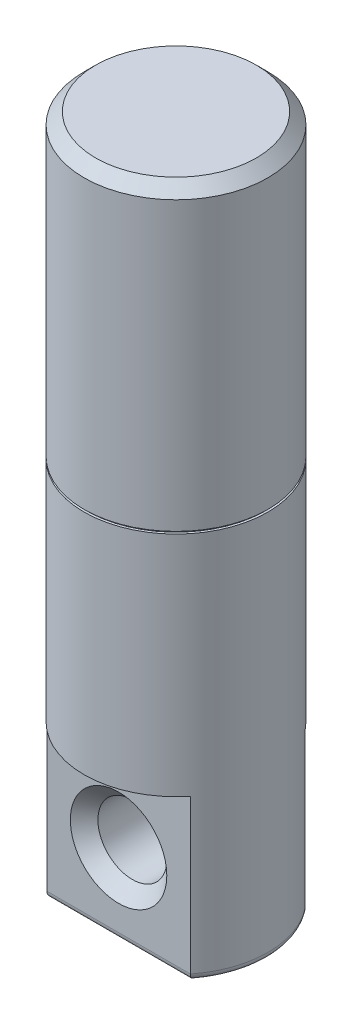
from build123d import *

# Parameters (mm, degrees)
SKETCH1_R               = 2
EXTRUDE1_DEPTH          = 15
CHAMFER1_SIZE           = 0.25
CUT_EXTRUDE1_DEPTH      = 3.5
SKETCH3_W               = 0.370716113
SKETCH3_H               = 0.05
CUT_EXTRUDE2_DEPTH      = 16.264337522
CUT_EXTRUDE2_DEPTH_BACK = 16.264337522
SKETCH4_R               = 0.75
CHAMFER2_SIZE           = 0.3
FILLET1_R               = 0.15


with BuildPart() as part:
    # Sketch1 → Extrude1 (new body)
    with BuildSketch(Plane(origin=(0, 0, 0), x_dir=(1, 0, 0), z_dir=(0, 1, 0))):
        with Locations(Location((0, 0, 0), (0, 0, 270))):
            Circle(SKETCH1_R)
    extrude(amount=EXTRUDE1_DEPTH)

    # Chamfer1
    chamfer1_edges = [part.edges().sort_by_distance(p)[0] for p in [
        (0, 15, -2),
    ]]
    chamfer(chamfer1_edges, length=CHAMFER1_SIZE)

    # Sketch2 → Cut-Extrude1 (cut)
    with BuildSketch(Plane.XZ):
        with BuildLine():
            Line((1.5612495, -1.25), (-1.5612495, -1.25))
            ThreePointArc((-1.5612495, -1.25), (0, -2), (1.5612495, -1.25))
        make_face()
    cut_extrude1 = extrude(amount=-CUT_EXTRUDE1_DEPTH, mode=Mode.SUBTRACT)

    # Mirror1: Cut-Extrude1 across plane
    add(cut_extrude1.mirror(Plane.XY), mode=Mode.SUBTRACT)

    # Sketch3 → Cut-Revolve1 (revolve, cut)
    with BuildSketch(Plane.XY, mode=Mode.PRIVATE) as cut_revolve1_sk:
        with Locations((2.135358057, 8.475)):
            Rectangle(SKETCH3_W, SKETCH3_H)
    revolve(cut_revolve1_sk.sketch.rotate(Axis((0, 0, 0), (0, 1, 0)), 90), axis=Axis((0, 0, 0), (0, 1, 0)), mode=Mode.SUBTRACT)

    # Sketch4 → Cut-Extrude2 (cut, two sides: drawn at the far end of the back side and taken through both)
    with BuildSketch(Plane.XY.offset(-CUT_EXTRUDE2_DEPTH_BACK)):
        with Locations((0, 1.75)):
            Circle(SKETCH4_R)
    extrude(amount=CUT_EXTRUDE2_DEPTH + CUT_EXTRUDE2_DEPTH_BACK, mode=Mode.SUBTRACT)

    # Chamfer2
    chamfer2_edges = [part.edges().sort_by_distance(p)[0] for p in [
        (-0.75, 1.75, -1.25),
        (-0.75, 1.75, 1.25),
    ]]
    chamfer(chamfer2_edges, length=CHAMFER2_SIZE)

    # Fillet1
    fillet1_edges = [part.edges().sort_by_distance(p)[0] for p in [
        (0, 0, -1.25),
        (2, 0, 0),
        (0, 0, 1.25),
        (-2, 0, 0),
    ]]
    fillet(fillet1_edges, radius=FILLET1_R)


solid = part.part
